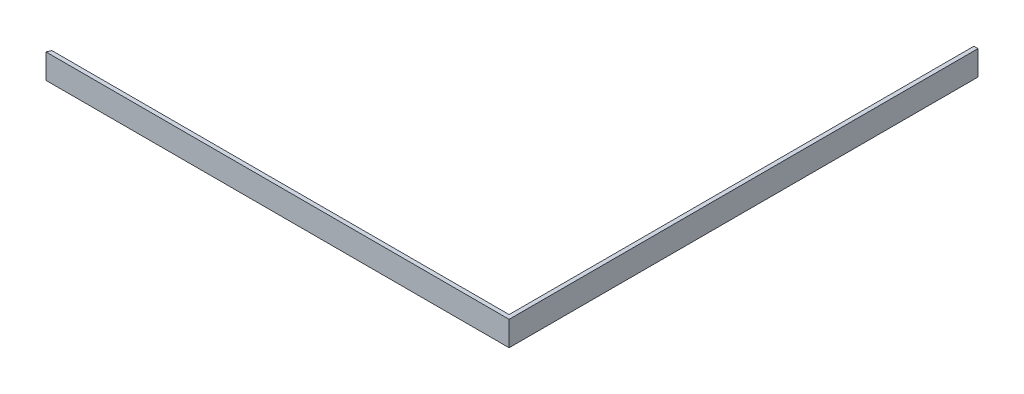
ISO-10303-21;
HEADER;
FILE_DESCRIPTION(('STEP AP214'),'2;1');
FILE_NAME('part.step','',(''),(''),'','','');
FILE_SCHEMA(('AUTOMOTIVE_DESIGN { 1 0 10303 214 1 1 1 1 }'));
ENDSEC;
DATA;
#1=APPLICATION_CONTEXT('core data for automotive mechanical design processes');
#2=APPLICATION_PROTOCOL_DEFINITION('international standard','automotive_design',2000,#1);
#3=PRODUCT_CONTEXT('',#1,'mechanical');
#4=PRODUCT('Part','Part','',(#3));
#5=PRODUCT_RELATED_PRODUCT_CATEGORY('part','',(#4));
#6=PRODUCT_DEFINITION_FORMATION('','',#4);
#7=PRODUCT_DEFINITION_CONTEXT('part definition',#1,'design');
#8=PRODUCT_DEFINITION('design','',#6,#7);
#9=PRODUCT_DEFINITION_SHAPE('','',#8);
#10=(LENGTH_UNIT() NAMED_UNIT(*) SI_UNIT(.MILLI.,.METRE.));
#11=(NAMED_UNIT(*) PLANE_ANGLE_UNIT() SI_UNIT($,.RADIAN.));
#12=(NAMED_UNIT(*) SI_UNIT($,.STERADIAN.) SOLID_ANGLE_UNIT());
#13=UNCERTAINTY_MEASURE_WITH_UNIT(LENGTH_MEASURE(1.E-05),#10,'distance_accuracy_value','');
#14=(GEOMETRIC_REPRESENTATION_CONTEXT(3) GLOBAL_UNCERTAINTY_ASSIGNED_CONTEXT((#13)) GLOBAL_UNIT_ASSIGNED_CONTEXT((#10,
#11,#12)) REPRESENTATION_CONTEXT('',''));
#15=CARTESIAN_POINT('',(0.,0.,0.));
#16=DIRECTION('',(0.,0.,1.));
#17=DIRECTION('',(1.,0.,0.));
#18=AXIS2_PLACEMENT_3D('',#15,#16,#17);
#19=CARTESIAN_POINT('',(0.,38.1,717.55));
#20=DIRECTION('',(1.,0.,0.));
#21=DIRECTION('',(0.,1.,0.));
#22=AXIS2_PLACEMENT_3D('',#19,#20,#21);
#23=PLANE('',#22);
#24=DIRECTION('',(0.,-1.,0.));
#25=VECTOR('',#24,1.);
#26=CARTESIAN_POINT('',(0.,0.,717.55));
#27=LINE('',#26,#25);
#28=CARTESIAN_POINT('',(0.,38.1,717.55));
#29=VERTEX_POINT('',#28);
#30=CARTESIAN_POINT('',(0.,0.,717.55));
#31=VERTEX_POINT('',#30);
#32=EDGE_CURVE('E101',#29,#31,#27,.T.);
#33=ORIENTED_EDGE('',*,*,#32,.F.);
#34=DIRECTION('',(0.,0.,-1.));
#35=VECTOR('',#34,1.);
#36=CARTESIAN_POINT('',(0.,38.1,717.55));
#37=LINE('',#36,#35);
#38=CARTESIAN_POINT('',(0.,38.1,0.));
#39=VERTEX_POINT('',#38);
#40=EDGE_CURVE('E144',#29,#39,#37,.T.);
#41=ORIENTED_EDGE('',*,*,#40,.T.);
#42=DIRECTION('',(0.,-1.,0.));
#43=VECTOR('',#42,1.);
#44=CARTESIAN_POINT('',(0.,38.1,0.));
#45=LINE('',#44,#43);
#46=CARTESIAN_POINT('',(0.,0.,0.));
#47=VERTEX_POINT('',#46);
#48=EDGE_CURVE('E137',#39,#47,#45,.T.);
#49=ORIENTED_EDGE('',*,*,#48,.T.);
#50=DIRECTION('',(0.,0.,-1.));
#51=VECTOR('',#50,1.);
#52=CARTESIAN_POINT('',(0.,0.,717.55));
#53=LINE('',#52,#51);
#54=EDGE_CURVE('E141',#31,#47,#53,.T.);
#55=ORIENTED_EDGE('',*,*,#54,.F.);
#56=EDGE_LOOP('',(#33,#41,#49,#55));
#57=FACE_BOUND('',#56,.T.);
#58=ADVANCED_FACE('F39',(#57),#23,.F.);
#59=CARTESIAN_POINT('',(0.,0.,717.55));
#60=DIRECTION('',(0.,1.,0.));
#61=DIRECTION('',(0.,0.,1.));
#62=AXIS2_PLACEMENT_3D('',#59,#60,#61);
#63=PLANE('',#62);
#64=DIRECTION('',(-1.,0.,0.));
#65=VECTOR('',#64,1.);
#66=CARTESIAN_POINT('',(44.9755420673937,0.,723.9));
#67=LINE('',#66,#65);
#68=CARTESIAN_POINT('',(6.35,0.,723.9));
#69=VERTEX_POINT('',#68);
#70=CARTESIAN_POINT('',(-708.634902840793,0.,723.9));
#71=VERTEX_POINT('',#70);
#72=EDGE_CURVE('E117',#69,#71,#67,.T.);
#73=ORIENTED_EDGE('',*,*,#72,.T.);
#74=DIRECTION('',(-0.390731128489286,0.,0.920504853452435));
#75=VECTOR('',#74,1.);
#76=CARTESIAN_POINT('',(-705.939487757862,0.,717.55));
#77=LINE('',#76,#75);
#78=CARTESIAN_POINT('',(-705.939487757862,0.,717.55));
#79=VERTEX_POINT('',#78);
#80=EDGE_CURVE('E95',#79,#71,#77,.T.);
#81=ORIENTED_EDGE('',*,*,#80,.F.);
#82=DIRECTION('',(1.,0.,0.));
#83=VECTOR('',#82,1.);
#84=CARTESIAN_POINT('',(-711.2,0.,717.55));
#85=LINE('',#84,#83);
#86=EDGE_CURVE('E123',#79,#31,#85,.T.);
#87=ORIENTED_EDGE('',*,*,#86,.T.);
#88=ORIENTED_EDGE('',*,*,#54,.T.);
#89=DIRECTION('',(1.,0.,0.));
#90=VECTOR('',#89,1.);
#91=CARTESIAN_POINT('',(0.,0.,0.));
#92=LINE('',#91,#90);
#93=CARTESIAN_POINT('',(6.35,0.,0.));
#94=VERTEX_POINT('',#93);
#95=EDGE_CURVE('E121',#47,#94,#92,.T.);
#96=ORIENTED_EDGE('',*,*,#95,.T.);
#97=DIRECTION('',(0.,0.,-1.));
#98=VECTOR('',#97,1.);
#99=CARTESIAN_POINT('',(6.35,0.,717.55));
#100=LINE('',#99,#98);
#101=EDGE_CURVE('E11',#69,#94,#100,.T.);
#102=ORIENTED_EDGE('',*,*,#101,.F.);
#103=EDGE_LOOP('',(#73,#81,#87,#88,#96,#102));
#104=FACE_BOUND('',#103,.T.);
#105=ADVANCED_FACE('F41',(#104),#63,.F.);
#106=CARTESIAN_POINT('',(6.35,0.,717.55));
#107=DIRECTION('',(-1.,0.,0.));
#108=DIRECTION('',(0.,0.,1.));
#109=AXIS2_PLACEMENT_3D('',#106,#107,#108);
#110=PLANE('',#109);
#111=DIRECTION('',(0.,1.,0.));
#112=VECTOR('',#111,1.);
#113=CARTESIAN_POINT('',(6.35,0.,0.));
#114=LINE('',#113,#112);
#115=CARTESIAN_POINT('',(6.35,38.1,0.));
#116=VERTEX_POINT('',#115);
#117=EDGE_CURVE('E130',#94,#116,#114,.T.);
#118=ORIENTED_EDGE('',*,*,#117,.T.);
#119=DIRECTION('',(0.,0.,-1.));
#120=VECTOR('',#119,1.);
#121=CARTESIAN_POINT('',(6.35,38.1,717.55));
#122=LINE('',#121,#120);
#123=CARTESIAN_POINT('',(6.35,38.1,723.9));
#124=VERTEX_POINT('',#123);
#125=EDGE_CURVE('E48',#124,#116,#122,.T.);
#126=ORIENTED_EDGE('',*,*,#125,.F.);
#127=DIRECTION('',(0.,1.,0.));
#128=VECTOR('',#127,1.);
#129=CARTESIAN_POINT('',(6.35,38.1,723.9));
#130=LINE('',#129,#128);
#131=EDGE_CURVE('E115',#69,#124,#130,.T.);
#132=ORIENTED_EDGE('',*,*,#131,.F.);
#133=ORIENTED_EDGE('',*,*,#101,.T.);
#134=EDGE_LOOP('',(#118,#126,#132,#133));
#135=FACE_BOUND('',#134,.T.);
#136=ADVANCED_FACE('F180',(#135),#110,.F.);
#137=CARTESIAN_POINT('',(0.,38.1,717.55));
#138=DIRECTION('',(0.,-1.,0.));
#139=DIRECTION('',(0.,0.,-1.));
#140=AXIS2_PLACEMENT_3D('',#137,#138,#139);
#141=PLANE('',#140);
#142=DIRECTION('',(1.,0.,0.));
#143=VECTOR('',#142,1.);
#144=CARTESIAN_POINT('',(-711.2,38.1,717.55));
#145=LINE('',#144,#143);
#146=CARTESIAN_POINT('',(-705.939487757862,38.1,717.55));
#147=VERTEX_POINT('',#146);
#148=EDGE_CURVE('E62',#147,#29,#145,.T.);
#149=ORIENTED_EDGE('',*,*,#148,.F.);
#150=DIRECTION('',(-0.390731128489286,0.,0.920504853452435));
#151=VECTOR('',#150,1.);
#152=CARTESIAN_POINT('',(-705.939487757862,38.1,717.55));
#153=LINE('',#152,#151);
#154=CARTESIAN_POINT('',(-708.634902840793,38.1,723.9));
#155=VERTEX_POINT('',#154);
#156=EDGE_CURVE('E55',#147,#155,#153,.T.);
#157=ORIENTED_EDGE('',*,*,#156,.T.);
#158=DIRECTION('',(-1.,0.,0.));
#159=VECTOR('',#158,1.);
#160=CARTESIAN_POINT('',(44.9755420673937,38.1,723.9));
#161=LINE('',#160,#159);
#162=EDGE_CURVE('E108',#124,#155,#161,.T.);
#163=ORIENTED_EDGE('',*,*,#162,.F.);
#164=ORIENTED_EDGE('',*,*,#125,.T.);
#165=DIRECTION('',(-1.,0.,0.));
#166=VECTOR('',#165,1.);
#167=CARTESIAN_POINT('',(0.,38.1,0.));
#168=LINE('',#167,#166);
#169=EDGE_CURVE('E133',#116,#39,#168,.T.);
#170=ORIENTED_EDGE('',*,*,#169,.T.);
#171=ORIENTED_EDGE('',*,*,#40,.F.);
#172=EDGE_LOOP('',(#149,#157,#163,#164,#170,#171));
#173=FACE_BOUND('',#172,.T.);
#174=ADVANCED_FACE('F106',(#173),#141,.F.);
#175=CARTESIAN_POINT('',(0.,0.,0.));
#176=DIRECTION('',(0.,0.,1.));
#177=DIRECTION('',(1.,0.,0.));
#178=AXIS2_PLACEMENT_3D('',#175,#176,#177);
#179=PLANE('',#178);
#180=ORIENTED_EDGE('',*,*,#95,.F.);
#181=ORIENTED_EDGE('',*,*,#48,.F.);
#182=ORIENTED_EDGE('',*,*,#169,.F.);
#183=ORIENTED_EDGE('',*,*,#117,.F.);
#184=EDGE_LOOP('',(#180,#181,#182,#183));
#185=FACE_BOUND('',#184,.T.);
#186=ADVANCED_FACE('F152',(#185),#179,.F.);
#187=CARTESIAN_POINT('',(44.9755420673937,38.1,723.9));
#188=DIRECTION('',(0.,0.,-1.));
#189=DIRECTION('',(-1.,0.,0.));
#190=AXIS2_PLACEMENT_3D('',#187,#188,#189);
#191=PLANE('',#190);
#192=ORIENTED_EDGE('',*,*,#162,.T.);
#193=DIRECTION('',(0.,-1.,0.));
#194=VECTOR('',#193,1.);
#195=CARTESIAN_POINT('',(-708.634902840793,38.1,723.9));
#196=LINE('',#195,#194);
#197=EDGE_CURVE('E92',#155,#71,#196,.T.);
#198=ORIENTED_EDGE('',*,*,#197,.T.);
#199=ORIENTED_EDGE('',*,*,#72,.F.);
#200=ORIENTED_EDGE('',*,*,#131,.T.);
#201=EDGE_LOOP('',(#192,#198,#199,#200));
#202=FACE_BOUND('',#201,.T.);
#203=ADVANCED_FACE('F113',(#202),#191,.F.);
#204=CARTESIAN_POINT('',(-711.2,0.,717.55));
#205=DIRECTION('',(0.,0.,1.));
#206=DIRECTION('',(1.,0.,0.));
#207=AXIS2_PLACEMENT_3D('',#204,#205,#206);
#208=PLANE('',#207);
#209=ORIENTED_EDGE('',*,*,#86,.F.);
#210=DIRECTION('',(0.,-1.,0.));
#211=VECTOR('',#210,1.);
#212=CARTESIAN_POINT('',(-705.939487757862,38.1,717.55));
#213=LINE('',#212,#211);
#214=EDGE_CURVE('E102',#147,#79,#213,.T.);
#215=ORIENTED_EDGE('',*,*,#214,.F.);
#216=ORIENTED_EDGE('',*,*,#148,.T.);
#217=ORIENTED_EDGE('',*,*,#32,.T.);
#218=EDGE_LOOP('',(#209,#215,#216,#217));
#219=FACE_BOUND('',#218,.T.);
#220=ADVANCED_FACE('F163',(#219),#208,.F.);
#221=CARTESIAN_POINT('',(-705.939487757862,38.1,717.55));
#222=DIRECTION('',(0.920504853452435,0.,0.390731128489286));
#223=DIRECTION('',(0.390731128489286,0.,-0.920504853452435));
#224=AXIS2_PLACEMENT_3D('',#221,#222,#223);
#225=PLANE('',#224);
#226=ORIENTED_EDGE('',*,*,#80,.T.);
#227=ORIENTED_EDGE('',*,*,#197,.F.);
#228=ORIENTED_EDGE('',*,*,#156,.F.);
#229=ORIENTED_EDGE('',*,*,#214,.T.);
#230=EDGE_LOOP('',(#226,#227,#228,#229));
#231=FACE_BOUND('',#230,.T.);
#232=ADVANCED_FACE('F93',(#231),#225,.F.);
#233=CLOSED_SHELL('',(#58,#105,#136,#174,#186,#203,#220,#232));
#234=MANIFOLD_SOLID_BREP('B2',#233);
#235=ADVANCED_BREP_SHAPE_REPRESENTATION('',(#18,#234),#14);
#236=SHAPE_DEFINITION_REPRESENTATION(#9,#235);
ENDSEC;
END-ISO-10303-21;
